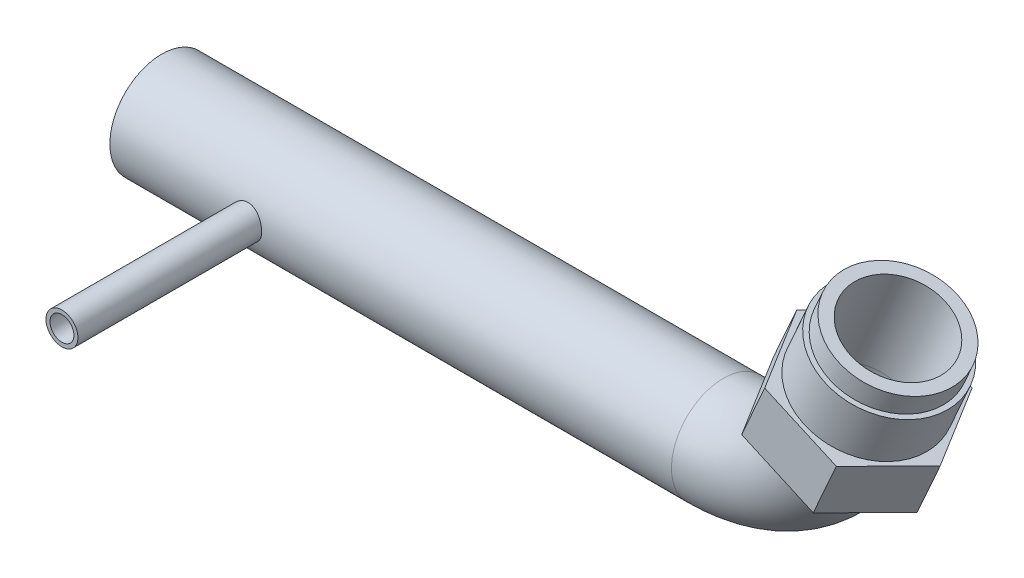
from build123d import *

# Parameters (mm, degrees)
ESQUISSE2_R                  = 6.5
ESQUISSE2_R_2                = 5.9
ESQUISSE3_R                  = 7.4
ESQUISSE3_R_2                = 5.9
BOSS_EXTRU_1_DEPTH           = 2.7
ESQUISSE4_R                  = 8
ESQUISSE4_R_2                = 6.55
BOSS_EXTRU_2_DEPTH           = 6.4
ESQUISSE5_R                  = 7
BOSS_EXTRU_3_DEPTH           = 7.1
ENL_V_START                  = -5
ESQUISSE6_R                  = 7.75
ESQUISSE6_R_2                = 7
ENL_V_MAT_EXTRU_1_DEPTH      = 5
BOSS_EXTRU_4_REACH           = 111.083
BOSS_EXTRU_4_END_RADIUS      = 6.5
ESQUISSE7_R                  = 2
ENL_V_MAT_EXTRU_2_REACH      = 111.083
ENL_V_MAT_EXTRU_2_END_RADIUS = 5.9
ESQUISSE8_R                  = 1.5


with BuildPart() as part:
    # Balayage1: sweep along a path in Esquisse1
    with BuildLine(Plane.XY) as balayage1_path:
        Line((0, 0), (70.310663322, 0))
        ThreePointArc((70.310663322, 0), (80.114165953, 2.903929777), (86.75448156, 10.678740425))
        Line((86.75448156, 10.678740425), (92.168416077, 22.838636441))
    # Esquisse2 → Balayage1 (sweep)
    with BuildSketch(Plane(origin=(0, 0, 0), x_dir=(0, 0, -1), z_dir=(1, 0, 0))):
        Circle(ESQUISSE2_R)
        Circle(ESQUISSE2_R_2, mode=Mode.SUBTRACT)
    sweep(path=balayage1_path.line)

    # Esquisse3 → Boss.-Extru.1 (add)
    with BuildSketch(Plane(origin=(23.734061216, 53.307574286, 0), x_dir=(0.9135454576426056, -0.40673664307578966, 0), z_dir=(0.40673664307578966, 0.9135454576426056, 0))):
        with Locations(Location((74.910727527, 0, 0), (0, 0, 180))):
            Circle(ESQUISSE3_R)
        with Locations(Location((74.910727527, 0, 0), (0, 0, 90))):
            Circle(ESQUISSE3_R_2, mode=Mode.SUBTRACT)
    extrude(amount=-BOSS_EXTRU_1_DEPTH)



with BuildPart() as body_2:
    # Esquisse4 → Boss.-Extru.2 (new body)
    with BuildSketch(Plane(origin=(22.63587228, 50.84100155, 0), x_dir=(0.9135454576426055, -0.4067366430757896, 0), z_dir=(-0.40673664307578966, -0.9135454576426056, 0))):
        with Locations((74.910727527, 0)):
            Circle(ESQUISSE4_R)
        with Locations((74.910727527, 0)):
            Circle(ESQUISSE4_R_2, mode=Mode.SUBTRACT)
    extrude(amount=BOSS_EXTRU_2_DEPTH)


with BuildPart() as part_1:
    add(part.part)

    add(body_2.part)  # Boss.-Extru.3 merges body 2
    # Esquisse5 → Boss.-Extru.3 (add)
    with BuildSketch(Plane(origin=(20.032757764, 44.994310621, 0), x_dir=(0.9135454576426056, -0.40673664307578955, 0), z_dir=(-0.40673664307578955, -0.9135454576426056, 0))):
        Polygon((84.725682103, 0), (79.818204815, 8.5), (70.003250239, 8.5), (65.09577295, 0), (70.003250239, -8.5), (79.818204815, -8.5), align=None)
        with Locations((74.910727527, 0)):
            Circle(ESQUISSE5_R, mode=Mode.SUBTRACT)
    extrude(amount=BOSS_EXTRU_3_DEPTH)

    # Esquisse6 → Enl_v. mat.-Extru.1 (cut)
    with BuildSketch(Plane(origin=(17.144927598, 38.508137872, 0), x_dir=(0.9135454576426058, -0.40673664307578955, 0), z_dir=(-0.4067366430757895, -0.9135454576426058, 0)).offset(ENL_V_START)):
        with Locations((74.910727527, 0)):
            Circle(ESQUISSE6_R)
        with Locations((74.910727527, 0)):
            Circle(ESQUISSE6_R_2, mode=Mode.SUBTRACT)
    extrude(amount=ENL_V_MAT_EXTRU_1_DEPTH, mode=Mode.SUBTRACT)

    # Boss.-Extru.4: up to this cylinder (the profile starts outside it)
    boss_extru_4_end = Plane(origin=(17, 0, 0), z_dir=(-1, 0, 0)) * Cylinder(BOSS_EXTRU_4_END_RADIUS, 236.166, mode=Mode.PRIVATE)
    # Esquisse7 → Boss.-Extru.4 (add, up to the surface)
    with BuildSketch(Plane.XY.offset(29.5), mode=Mode.PRIVATE) as boss_extru_4_sk1:
        with Locations((17, 0)):
            Circle(ESQUISSE7_R)
    boss_extru_4_tool1 = extrude(boss_extru_4_sk1.sketch, amount=-BOSS_EXTRU_4_REACH, mode=Mode.PRIVATE) - boss_extru_4_end
    add(boss_extru_4_tool1.solids().sort_by_distance((17, 0, 29.5))[0])

    # Enl_v. mat.-Extru.2: up to this cylinder (the profile starts outside it)
    enl_v_mat_extru_2_end = Plane(origin=(17, 0, 0), z_dir=(-1, 0, 0)) * Cylinder(ENL_V_MAT_EXTRU_2_END_RADIUS, 234.966, mode=Mode.PRIVATE)
    # Esquisse8 → Enl_v. mat.-Extru.2 (cut, up to the surface)
    with BuildSketch(Plane.XY.offset(29.5), mode=Mode.PRIVATE) as enl_v_mat_extru_2_sk1:
        with Locations((17, 0)):
            Circle(ESQUISSE8_R)
    enl_v_mat_extru_2_tool1 = extrude(enl_v_mat_extru_2_sk1.sketch, amount=-ENL_V_MAT_EXTRU_2_REACH, mode=Mode.PRIVATE) - enl_v_mat_extru_2_end
    add(enl_v_mat_extru_2_tool1.solids().sort_by_distance((17, 0, 29.5))[0], mode=Mode.SUBTRACT)


solid = part_1.part
